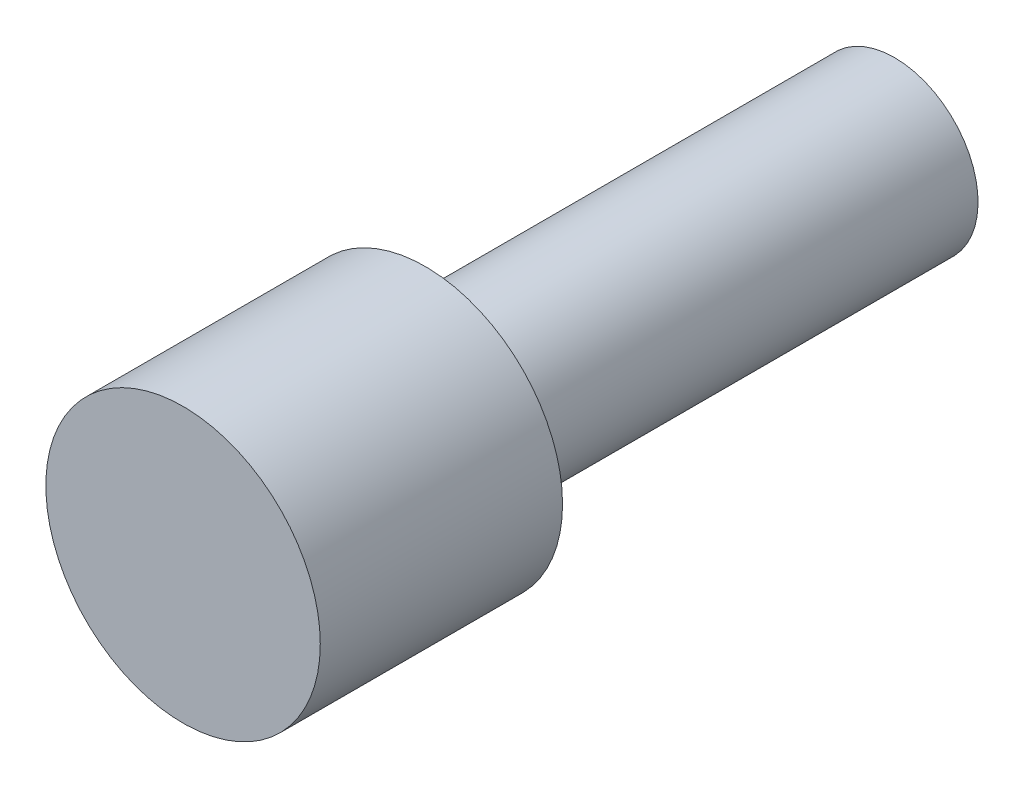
from build123d import *

# Parameters (mm, degrees)
SKETCH1_R           = 8.1
BOSS_EXTRUDE1_DEPTH = 14.3
SKETCH2_R           = 4.9265
BOSS_EXTRUDE2_DEPTH = 27.7


with BuildPart() as part:
    # Sketch1 → Boss-Extrude1 (new body)
    with BuildSketch(Plane.XY):
        Circle(SKETCH1_R)
    extrude(amount=-BOSS_EXTRUDE1_DEPTH)

    # Sketch2 → Boss-Extrude2 (add)
    with BuildSketch(Plane(origin=(0, 0, -14.3), x_dir=(-1, 0, 0), z_dir=(0, 0, -1))):
        with Locations(Location((1.7584e-05, 0.000109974, 0), (0, 0, 90))):
            Circle(SKETCH2_R)
    extrude(amount=BOSS_EXTRUDE2_DEPTH)


solid = part.part
